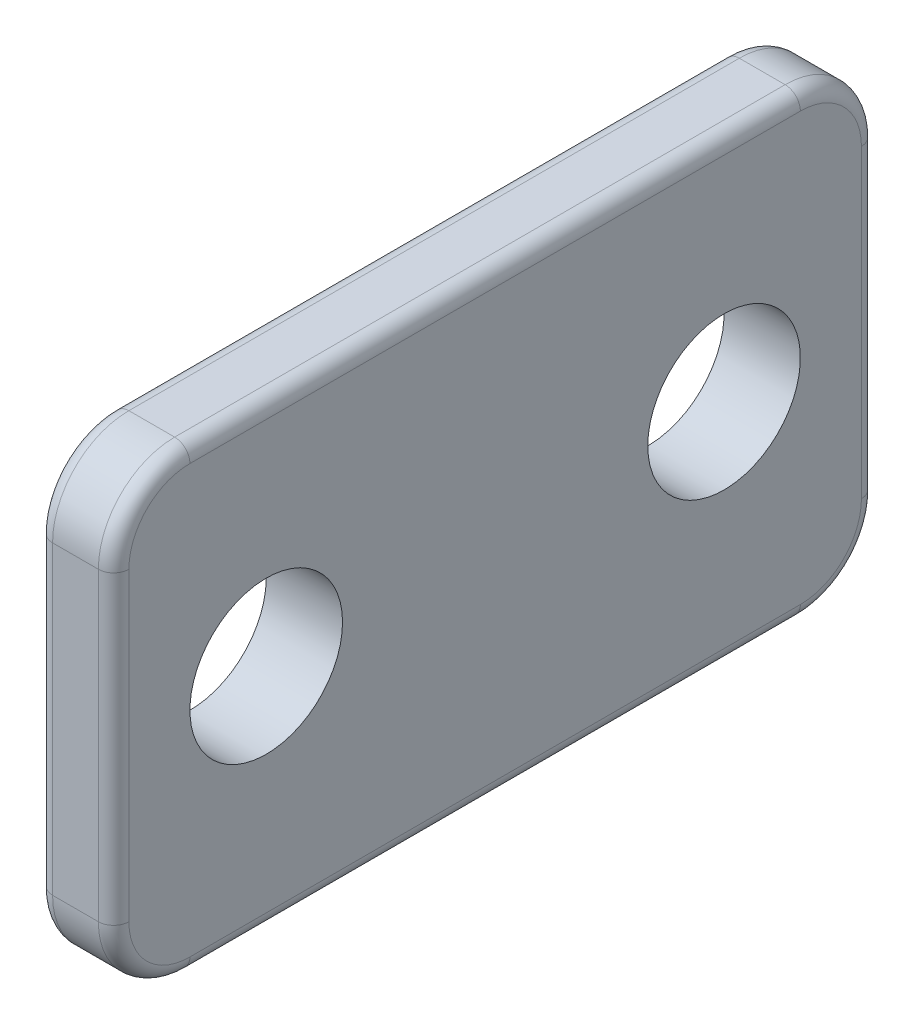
ISO-10303-21;
HEADER;
FILE_DESCRIPTION(('STEP AP214'),'2;1');
FILE_NAME('part.step','',(''),(''),'','','');
FILE_SCHEMA(('AUTOMOTIVE_DESIGN { 1 0 10303 214 1 1 1 1 }'));
ENDSEC;
DATA;
#1=APPLICATION_CONTEXT('core data for automotive mechanical design processes');
#2=APPLICATION_PROTOCOL_DEFINITION('international standard','automotive_design',2000,#1);
#3=PRODUCT_CONTEXT('',#1,'mechanical');
#4=PRODUCT('Part','Part','',(#3));
#5=PRODUCT_RELATED_PRODUCT_CATEGORY('part','',(#4));
#6=PRODUCT_DEFINITION_FORMATION('','',#4);
#7=PRODUCT_DEFINITION_CONTEXT('part definition',#1,'design');
#8=PRODUCT_DEFINITION('design','',#6,#7);
#9=PRODUCT_DEFINITION_SHAPE('','',#8);
#10=(LENGTH_UNIT() NAMED_UNIT(*) SI_UNIT(.MILLI.,.METRE.));
#11=(NAMED_UNIT(*) PLANE_ANGLE_UNIT() SI_UNIT($,.RADIAN.));
#12=(NAMED_UNIT(*) SI_UNIT($,.STERADIAN.) SOLID_ANGLE_UNIT());
#13=UNCERTAINTY_MEASURE_WITH_UNIT(LENGTH_MEASURE(1.E-05),#10,'distance_accuracy_value','');
#14=(GEOMETRIC_REPRESENTATION_CONTEXT(3) GLOBAL_UNCERTAINTY_ASSIGNED_CONTEXT((#13)) GLOBAL_UNIT_ASSIGNED_CONTEXT((#10,
#11,#12)) REPRESENTATION_CONTEXT('',''));
#15=CARTESIAN_POINT('',(0.,0.,0.));
#16=DIRECTION('',(0.,0.,1.));
#17=DIRECTION('',(1.,0.,0.));
#18=AXIS2_PLACEMENT_3D('',#15,#16,#17);
#19=CARTESIAN_POINT('',(2.5,10.,20.));
#20=DIRECTION('',(-1.,0.,0.));
#21=DIRECTION('',(0.,0.,-1.));
#22=AXIS2_PLACEMENT_3D('',#19,#20,#21);
#23=PLANE('',#22);
#24=DIRECTION('',(0.,1.,0.));
#25=VECTOR('',#24,1.);
#26=CARTESIAN_POINT('',(2.5,10.,24.));
#27=LINE('',#26,#25);
#28=CARTESIAN_POINT('',(2.5,-10.,24.));
#29=VERTEX_POINT('',#28);
#30=CARTESIAN_POINT('',(2.5,9.99999999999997,24.));
#31=VERTEX_POINT('',#30);
#32=EDGE_CURVE('E261',#29,#31,#27,.T.);
#33=ORIENTED_EDGE('',*,*,#32,.F.);
#34=CARTESIAN_POINT('',(2.5,-10.,20.));
#35=DIRECTION('',(1.,0.,0.));
#36=DIRECTION('',(0.,0.,-1.));
#37=AXIS2_PLACEMENT_3D('',#34,#35,#36);
#38=CIRCLE('',#37,4.);
#39=CARTESIAN_POINT('',(2.5,-14.,20.));
#40=VERTEX_POINT('',#39);
#41=EDGE_CURVE('E259',#40,#29,#38,.F.);
#42=ORIENTED_EDGE('',*,*,#41,.F.);
#43=DIRECTION('',(0.,0.,1.));
#44=VECTOR('',#43,1.);
#45=CARTESIAN_POINT('',(2.5,-14.,20.));
#46=LINE('',#45,#44);
#47=CARTESIAN_POINT('',(2.5,-14.,-20.));
#48=VERTEX_POINT('',#47);
#49=EDGE_CURVE('E256',#48,#40,#46,.T.);
#50=ORIENTED_EDGE('',*,*,#49,.F.);
#51=CARTESIAN_POINT('',(2.5,-10.,-20.));
#52=DIRECTION('',(1.,0.,0.));
#53=DIRECTION('',(0.,0.,-1.));
#54=AXIS2_PLACEMENT_3D('',#51,#52,#53);
#55=CIRCLE('',#54,4.);
#56=CARTESIAN_POINT('',(2.5,-9.99999999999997,-24.));
#57=VERTEX_POINT('',#56);
#58=EDGE_CURVE('E253',#57,#48,#55,.F.);
#59=ORIENTED_EDGE('',*,*,#58,.F.);
#60=DIRECTION('',(0.,-1.,0.));
#61=VECTOR('',#60,1.);
#62=CARTESIAN_POINT('',(2.5,10.,-24.));
#63=LINE('',#62,#61);
#64=CARTESIAN_POINT('',(2.5,9.99999999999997,-24.));
#65=VERTEX_POINT('',#64);
#66=EDGE_CURVE('E250',#65,#57,#63,.T.);
#67=ORIENTED_EDGE('',*,*,#66,.F.);
#68=CARTESIAN_POINT('',(2.5,10.,-20.));
#69=DIRECTION('',(1.,0.,0.));
#70=DIRECTION('',(0.,0.,-1.));
#71=AXIS2_PLACEMENT_3D('',#68,#69,#70);
#72=CIRCLE('',#71,4.);
#73=CARTESIAN_POINT('',(2.5,14.,-20.));
#74=VERTEX_POINT('',#73);
#75=EDGE_CURVE('E247',#74,#65,#72,.F.);
#76=ORIENTED_EDGE('',*,*,#75,.F.);
#77=DIRECTION('',(0.,0.,-1.));
#78=VECTOR('',#77,1.);
#79=CARTESIAN_POINT('',(2.5,14.,20.));
#80=LINE('',#79,#78);
#81=CARTESIAN_POINT('',(2.5,14.,20.));
#82=VERTEX_POINT('',#81);
#83=EDGE_CURVE('E245',#82,#74,#80,.T.);
#84=ORIENTED_EDGE('',*,*,#83,.F.);
#85=CARTESIAN_POINT('',(2.5,10.,20.));
#86=DIRECTION('',(1.,0.,0.));
#87=DIRECTION('',(0.,0.,-1.));
#88=AXIS2_PLACEMENT_3D('',#85,#86,#87);
#89=CIRCLE('',#88,4.);
#90=EDGE_CURVE('E157',#31,#82,#89,.F.);
#91=ORIENTED_EDGE('',*,*,#90,.F.);
#92=EDGE_LOOP('',(#33,#42,#50,#59,#67,#76,#84,#91));
#93=FACE_BOUND('',#92,.T.);
#94=CARTESIAN_POINT('',(2.5,0.,-15.));
#95=DIRECTION('',(-1.,0.,0.));
#96=DIRECTION('',(0.,0.,1.));
#97=AXIS2_PLACEMENT_3D('',#94,#95,#96);
#98=CIRCLE('',#97,5.);
#99=CARTESIAN_POINT('',(2.5,0.,-10.));
#100=VERTEX_POINT('',#99);
#101=EDGE_CURVE('E365',#100,#100,#98,.T.);
#102=ORIENTED_EDGE('',*,*,#101,.T.);
#103=EDGE_LOOP('',(#102));
#104=FACE_BOUND('',#103,.T.);
#105=CARTESIAN_POINT('',(2.5,0.,15.));
#106=DIRECTION('',(-1.,0.,0.));
#107=DIRECTION('',(0.,0.,-1.));
#108=AXIS2_PLACEMENT_3D('',#105,#106,#107);
#109=CIRCLE('',#108,5.);
#110=CARTESIAN_POINT('',(2.5,0.,10.));
#111=VERTEX_POINT('',#110);
#112=EDGE_CURVE('E371',#111,#111,#109,.T.);
#113=ORIENTED_EDGE('',*,*,#112,.T.);
#114=EDGE_LOOP('',(#113));
#115=FACE_BOUND('',#114,.T.);
#116=ADVANCED_FACE('F37',(#93,#104,#115),#23,.F.);
#117=CARTESIAN_POINT('',(-2.5,10.,20.));
#118=DIRECTION('',(-1.,0.,0.));
#119=DIRECTION('',(0.,0.,-1.));
#120=AXIS2_PLACEMENT_3D('',#117,#118,#119);
#121=PLANE('',#120);
#122=DIRECTION('',(0.,0.,-1.));
#123=VECTOR('',#122,1.);
#124=CARTESIAN_POINT('',(-2.5,14.,20.));
#125=LINE('',#124,#123);
#126=CARTESIAN_POINT('',(-2.5,14.,-20.));
#127=VERTEX_POINT('',#126);
#128=CARTESIAN_POINT('',(-2.5,14.,20.));
#129=VERTEX_POINT('',#128);
#130=EDGE_CURVE('E184',#127,#129,#125,.F.);
#131=ORIENTED_EDGE('',*,*,#130,.F.);
#132=CARTESIAN_POINT('',(-2.5,10.,-20.));
#133=DIRECTION('',(1.,0.,0.));
#134=DIRECTION('',(0.,0.,-1.));
#135=AXIS2_PLACEMENT_3D('',#132,#133,#134);
#136=CIRCLE('',#135,4.);
#137=CARTESIAN_POINT('',(-2.5,9.99999999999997,-24.));
#138=VERTEX_POINT('',#137);
#139=EDGE_CURVE('E190',#138,#127,#136,.T.);
#140=ORIENTED_EDGE('',*,*,#139,.F.);
#141=DIRECTION('',(0.,-1.,0.));
#142=VECTOR('',#141,1.);
#143=CARTESIAN_POINT('',(-2.5,9.99999999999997,-24.));
#144=LINE('',#143,#142);
#145=CARTESIAN_POINT('',(-2.5,-9.99999999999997,-24.));
#146=VERTEX_POINT('',#145);
#147=EDGE_CURVE('E193',#146,#138,#144,.F.);
#148=ORIENTED_EDGE('',*,*,#147,.F.);
#149=CARTESIAN_POINT('',(-2.5,-10.,-20.));
#150=DIRECTION('',(1.,0.,0.));
#151=DIRECTION('',(0.,0.,-1.));
#152=AXIS2_PLACEMENT_3D('',#149,#150,#151);
#153=CIRCLE('',#152,4.);
#154=CARTESIAN_POINT('',(-2.5,-14.,-20.));
#155=VERTEX_POINT('',#154);
#156=EDGE_CURVE('E196',#155,#146,#153,.T.);
#157=ORIENTED_EDGE('',*,*,#156,.F.);
#158=DIRECTION('',(0.,0.,1.));
#159=VECTOR('',#158,1.);
#160=CARTESIAN_POINT('',(-2.5,-14.,-20.));
#161=LINE('',#160,#159);
#162=CARTESIAN_POINT('',(-2.5,-14.,20.));
#163=VERTEX_POINT('',#162);
#164=EDGE_CURVE('E199',#163,#155,#161,.F.);
#165=ORIENTED_EDGE('',*,*,#164,.F.);
#166=CARTESIAN_POINT('',(-2.5,-10.,20.));
#167=DIRECTION('',(1.,0.,0.));
#168=DIRECTION('',(0.,0.,-1.));
#169=AXIS2_PLACEMENT_3D('',#166,#167,#168);
#170=CIRCLE('',#169,4.);
#171=CARTESIAN_POINT('',(-2.5,-10.,24.));
#172=VERTEX_POINT('',#171);
#173=EDGE_CURVE('E202',#172,#163,#170,.T.);
#174=ORIENTED_EDGE('',*,*,#173,.F.);
#175=DIRECTION('',(0.,1.,0.));
#176=VECTOR('',#175,1.);
#177=CARTESIAN_POINT('',(-2.5,-10.,24.));
#178=LINE('',#177,#176);
#179=CARTESIAN_POINT('',(-2.5,9.99999999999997,24.));
#180=VERTEX_POINT('',#179);
#181=EDGE_CURVE('E205',#180,#172,#178,.F.);
#182=ORIENTED_EDGE('',*,*,#181,.F.);
#183=CARTESIAN_POINT('',(-2.5,10.,20.));
#184=DIRECTION('',(1.,0.,0.));
#185=DIRECTION('',(0.,0.,-1.));
#186=AXIS2_PLACEMENT_3D('',#183,#184,#185);
#187=CIRCLE('',#186,4.);
#188=EDGE_CURVE('E208',#129,#180,#187,.T.);
#189=ORIENTED_EDGE('',*,*,#188,.F.);
#190=EDGE_LOOP('',(#131,#140,#148,#157,#165,#174,#182,#189));
#191=FACE_BOUND('',#190,.T.);
#192=CARTESIAN_POINT('',(-2.5,0.,-15.));
#193=DIRECTION('',(-1.,0.,0.));
#194=DIRECTION('',(0.,0.,1.));
#195=AXIS2_PLACEMENT_3D('',#192,#193,#194);
#196=CIRCLE('',#195,5.);
#197=CARTESIAN_POINT('',(-2.5,0.,-10.));
#198=VERTEX_POINT('',#197);
#199=EDGE_CURVE('E367',#198,#198,#196,.T.);
#200=ORIENTED_EDGE('',*,*,#199,.F.);
#201=EDGE_LOOP('',(#200));
#202=FACE_BOUND('',#201,.T.);
#203=CARTESIAN_POINT('',(-2.5,0.,15.));
#204=DIRECTION('',(-1.,0.,0.));
#205=DIRECTION('',(0.,0.,-1.));
#206=AXIS2_PLACEMENT_3D('',#203,#204,#205);
#207=CIRCLE('',#206,5.);
#208=CARTESIAN_POINT('',(-2.5,0.,10.));
#209=VERTEX_POINT('',#208);
#210=EDGE_CURVE('E279',#209,#209,#207,.T.);
#211=ORIENTED_EDGE('',*,*,#210,.F.);
#212=EDGE_LOOP('',(#211));
#213=FACE_BOUND('',#212,.T.);
#214=ADVANCED_FACE('F353',(#191,#202,#213),#121,.T.);
#215=CARTESIAN_POINT('',(2.5,10.,20.));
#216=DIRECTION('',(-1.,0.,0.));
#217=DIRECTION('',(0.,0.,-1.));
#218=AXIS2_PLACEMENT_3D('',#215,#216,#217);
#219=CYLINDRICAL_SURFACE('',#218,5.);
#220=DIRECTION('',(-1.,0.,0.));
#221=VECTOR('',#220,1.);
#222=CARTESIAN_POINT('',(2.5,9.99999999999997,25.));
#223=LINE('',#222,#221);
#224=CARTESIAN_POINT('',(1.5,9.99999999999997,25.));
#225=VERTEX_POINT('',#224);
#226=CARTESIAN_POINT('',(-1.5,9.99999999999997,25.));
#227=VERTEX_POINT('',#226);
#228=EDGE_CURVE('E181',#225,#227,#223,.T.);
#229=ORIENTED_EDGE('',*,*,#228,.F.);
#230=CARTESIAN_POINT('',(1.5,10.,20.));
#231=DIRECTION('',(1.,0.,0.));
#232=DIRECTION('',(0.,0.,-1.));
#233=AXIS2_PLACEMENT_3D('',#230,#231,#232);
#234=CIRCLE('',#233,5.);
#235=CARTESIAN_POINT('',(1.5,15.,20.));
#236=VERTEX_POINT('',#235);
#237=EDGE_CURVE('E155',#236,#225,#234,.T.);
#238=ORIENTED_EDGE('',*,*,#237,.F.);
#239=DIRECTION('',(-1.,0.,0.));
#240=VECTOR('',#239,1.);
#241=CARTESIAN_POINT('',(2.5,15.,20.));
#242=LINE('',#241,#240);
#243=CARTESIAN_POINT('',(-1.5,15.,20.));
#244=VERTEX_POINT('',#243);
#245=EDGE_CURVE('E172',#236,#244,#242,.T.);
#246=ORIENTED_EDGE('',*,*,#245,.T.);
#247=CARTESIAN_POINT('',(-1.5,10.,20.));
#248=DIRECTION('',(1.,0.,0.));
#249=DIRECTION('',(0.,0.,-1.));
#250=AXIS2_PLACEMENT_3D('',#247,#248,#249);
#251=CIRCLE('',#250,5.);
#252=EDGE_CURVE('E182',#227,#244,#251,.F.);
#253=ORIENTED_EDGE('',*,*,#252,.F.);
#254=EDGE_LOOP('',(#229,#238,#246,#253));
#255=FACE_BOUND('',#254,.T.);
#256=ADVANCED_FACE('F179',(#255),#219,.T.);
#257=CARTESIAN_POINT('',(2.5,15.,-20.));
#258=DIRECTION('',(0.,-1.,0.));
#259=DIRECTION('',(0.,0.,1.));
#260=AXIS2_PLACEMENT_3D('',#257,#258,#259);
#261=PLANE('',#260);
#262=ORIENTED_EDGE('',*,*,#245,.F.);
#263=DIRECTION('',(0.,0.,-1.));
#264=VECTOR('',#263,1.);
#265=CARTESIAN_POINT('',(1.5,15.,-20.));
#266=LINE('',#265,#264);
#267=CARTESIAN_POINT('',(1.5,15.,-20.));
#268=VERTEX_POINT('',#267);
#269=EDGE_CURVE('E46',#268,#236,#266,.F.);
#270=ORIENTED_EDGE('',*,*,#269,.F.);
#271=DIRECTION('',(-1.,0.,0.));
#272=VECTOR('',#271,1.);
#273=CARTESIAN_POINT('',(2.5,15.,-20.));
#274=LINE('',#273,#272);
#275=CARTESIAN_POINT('',(-1.5,15.,-20.));
#276=VERTEX_POINT('',#275);
#277=EDGE_CURVE('E177',#268,#276,#274,.T.);
#278=ORIENTED_EDGE('',*,*,#277,.T.);
#279=DIRECTION('',(0.,0.,-1.));
#280=VECTOR('',#279,1.);
#281=CARTESIAN_POINT('',(-1.5,15.,-20.));
#282=LINE('',#281,#280);
#283=EDGE_CURVE('E11',#244,#276,#282,.T.);
#284=ORIENTED_EDGE('',*,*,#283,.F.);
#285=EDGE_LOOP('',(#262,#270,#278,#284));
#286=FACE_BOUND('',#285,.T.);
#287=ADVANCED_FACE('F173',(#286),#261,.F.);
#288=CARTESIAN_POINT('',(2.5,10.,-20.));
#289=DIRECTION('',(-1.,0.,0.));
#290=DIRECTION('',(0.,0.,-1.));
#291=AXIS2_PLACEMENT_3D('',#288,#289,#290);
#292=CYLINDRICAL_SURFACE('',#291,5.);
#293=ORIENTED_EDGE('',*,*,#277,.F.);
#294=CARTESIAN_POINT('',(1.5,10.,-20.));
#295=DIRECTION('',(1.,0.,0.));
#296=DIRECTION('',(0.,0.,-1.));
#297=AXIS2_PLACEMENT_3D('',#294,#295,#296);
#298=CIRCLE('',#297,5.);
#299=CARTESIAN_POINT('',(1.5,9.99999999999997,-25.));
#300=VERTEX_POINT('',#299);
#301=EDGE_CURVE('E240',#300,#268,#298,.T.);
#302=ORIENTED_EDGE('',*,*,#301,.F.);
#303=DIRECTION('',(-1.,0.,0.));
#304=VECTOR('',#303,1.);
#305=CARTESIAN_POINT('',(2.5,9.99999999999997,-25.));
#306=LINE('',#305,#304);
#307=CARTESIAN_POINT('',(-1.5,9.99999999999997,-25.));
#308=VERTEX_POINT('',#307);
#309=EDGE_CURVE('E313',#300,#308,#306,.T.);
#310=ORIENTED_EDGE('',*,*,#309,.T.);
#311=CARTESIAN_POINT('',(-1.5,10.,-20.));
#312=DIRECTION('',(1.,0.,0.));
#313=DIRECTION('',(0.,0.,-1.));
#314=AXIS2_PLACEMENT_3D('',#311,#312,#313);
#315=CIRCLE('',#314,5.);
#316=EDGE_CURVE('E242',#276,#308,#315,.F.);
#317=ORIENTED_EDGE('',*,*,#316,.F.);
#318=EDGE_LOOP('',(#293,#302,#310,#317));
#319=FACE_BOUND('',#318,.T.);
#320=ADVANCED_FACE('F343',(#319),#292,.T.);
#321=CARTESIAN_POINT('',(2.5,9.99999999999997,-25.));
#322=DIRECTION('',(0.,0.,1.));
#323=DIRECTION('',(-1.,0.,0.));
#324=AXIS2_PLACEMENT_3D('',#321,#322,#323);
#325=PLANE('',#324);
#326=ORIENTED_EDGE('',*,*,#309,.F.);
#327=DIRECTION('',(0.,-1.,0.));
#328=VECTOR('',#327,1.);
#329=CARTESIAN_POINT('',(1.5,9.99999999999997,-25.));
#330=LINE('',#329,#328);
#331=CARTESIAN_POINT('',(1.5,-9.99999999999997,-25.));
#332=VERTEX_POINT('',#331);
#333=EDGE_CURVE('E234',#332,#300,#330,.F.);
#334=ORIENTED_EDGE('',*,*,#333,.F.);
#335=DIRECTION('',(-1.,0.,0.));
#336=VECTOR('',#335,1.);
#337=CARTESIAN_POINT('',(2.5,-9.99999999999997,-25.));
#338=LINE('',#337,#336);
#339=CARTESIAN_POINT('',(-1.5,-9.99999999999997,-25.));
#340=VERTEX_POINT('',#339);
#341=EDGE_CURVE('E305',#332,#340,#338,.T.);
#342=ORIENTED_EDGE('',*,*,#341,.T.);
#343=DIRECTION('',(0.,-1.,0.));
#344=VECTOR('',#343,1.);
#345=CARTESIAN_POINT('',(-1.5,-9.99999999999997,-25.));
#346=LINE('',#345,#344);
#347=EDGE_CURVE('E237',#308,#340,#346,.T.);
#348=ORIENTED_EDGE('',*,*,#347,.F.);
#349=EDGE_LOOP('',(#326,#334,#342,#348));
#350=FACE_BOUND('',#349,.T.);
#351=ADVANCED_FACE('F316',(#350),#325,.F.);
#352=CARTESIAN_POINT('',(2.5,-10.,-20.));
#353=DIRECTION('',(-1.,0.,0.));
#354=DIRECTION('',(0.,0.,-1.));
#355=AXIS2_PLACEMENT_3D('',#352,#353,#354);
#356=CYLINDRICAL_SURFACE('',#355,5.);
#357=ORIENTED_EDGE('',*,*,#341,.F.);
#358=CARTESIAN_POINT('',(1.5,-10.,-20.));
#359=DIRECTION('',(1.,0.,0.));
#360=DIRECTION('',(0.,0.,-1.));
#361=AXIS2_PLACEMENT_3D('',#358,#359,#360);
#362=CIRCLE('',#361,5.);
#363=CARTESIAN_POINT('',(1.5,-15.,-20.));
#364=VERTEX_POINT('',#363);
#365=EDGE_CURVE('E228',#364,#332,#362,.T.);
#366=ORIENTED_EDGE('',*,*,#365,.F.);
#367=DIRECTION('',(-1.,0.,0.));
#368=VECTOR('',#367,1.);
#369=CARTESIAN_POINT('',(2.5,-15.,-20.));
#370=LINE('',#369,#368);
#371=CARTESIAN_POINT('',(-1.5,-15.,-20.));
#372=VERTEX_POINT('',#371);
#373=EDGE_CURVE('E301',#364,#372,#370,.T.);
#374=ORIENTED_EDGE('',*,*,#373,.T.);
#375=CARTESIAN_POINT('',(-1.5,-10.,-20.));
#376=DIRECTION('',(1.,0.,0.));
#377=DIRECTION('',(0.,0.,-1.));
#378=AXIS2_PLACEMENT_3D('',#375,#376,#377);
#379=CIRCLE('',#378,5.);
#380=EDGE_CURVE('E231',#340,#372,#379,.F.);
#381=ORIENTED_EDGE('',*,*,#380,.F.);
#382=EDGE_LOOP('',(#357,#366,#374,#381));
#383=FACE_BOUND('',#382,.T.);
#384=ADVANCED_FACE('F308',(#383),#356,.T.);
#385=CARTESIAN_POINT('',(2.5,-15.,-20.));
#386=DIRECTION('',(0.,1.,0.));
#387=DIRECTION('',(0.,0.,-1.));
#388=AXIS2_PLACEMENT_3D('',#385,#386,#387);
#389=PLANE('',#388);
#390=ORIENTED_EDGE('',*,*,#373,.F.);
#391=DIRECTION('',(0.,0.,1.));
#392=VECTOR('',#391,1.);
#393=CARTESIAN_POINT('',(1.5,-15.,-20.));
#394=LINE('',#393,#392);
#395=CARTESIAN_POINT('',(1.5,-15.,20.));
#396=VERTEX_POINT('',#395);
#397=EDGE_CURVE('E222',#396,#364,#394,.F.);
#398=ORIENTED_EDGE('',*,*,#397,.F.);
#399=DIRECTION('',(-1.,0.,0.));
#400=VECTOR('',#399,1.);
#401=CARTESIAN_POINT('',(2.5,-15.,20.));
#402=LINE('',#401,#400);
#403=CARTESIAN_POINT('',(-1.5,-15.,20.));
#404=VERTEX_POINT('',#403);
#405=EDGE_CURVE('E306',#396,#404,#402,.T.);
#406=ORIENTED_EDGE('',*,*,#405,.T.);
#407=DIRECTION('',(0.,0.,1.));
#408=VECTOR('',#407,1.);
#409=CARTESIAN_POINT('',(-1.5,-15.,20.));
#410=LINE('',#409,#408);
#411=EDGE_CURVE('E225',#372,#404,#410,.T.);
#412=ORIENTED_EDGE('',*,*,#411,.F.);
#413=EDGE_LOOP('',(#390,#398,#406,#412));
#414=FACE_BOUND('',#413,.T.);
#415=ADVANCED_FACE('F302',(#414),#389,.F.);
#416=CARTESIAN_POINT('',(2.5,-10.,20.));
#417=DIRECTION('',(-1.,0.,0.));
#418=DIRECTION('',(0.,0.,-1.));
#419=AXIS2_PLACEMENT_3D('',#416,#417,#418);
#420=CYLINDRICAL_SURFACE('',#419,5.);
#421=ORIENTED_EDGE('',*,*,#405,.F.);
#422=CARTESIAN_POINT('',(1.5,-10.,20.));
#423=DIRECTION('',(1.,0.,0.));
#424=DIRECTION('',(0.,0.,-1.));
#425=AXIS2_PLACEMENT_3D('',#422,#423,#424);
#426=CIRCLE('',#425,5.);
#427=CARTESIAN_POINT('',(1.5,-10.,25.));
#428=VERTEX_POINT('',#427);
#429=EDGE_CURVE('E216',#428,#396,#426,.T.);
#430=ORIENTED_EDGE('',*,*,#429,.F.);
#431=DIRECTION('',(-1.,0.,0.));
#432=VECTOR('',#431,1.);
#433=CARTESIAN_POINT('',(2.5,-10.,25.));
#434=LINE('',#433,#432);
#435=CARTESIAN_POINT('',(-1.5,-10.,25.));
#436=VERTEX_POINT('',#435);
#437=EDGE_CURVE('E335',#428,#436,#434,.T.);
#438=ORIENTED_EDGE('',*,*,#437,.T.);
#439=CARTESIAN_POINT('',(-1.5,-10.,20.));
#440=DIRECTION('',(1.,0.,0.));
#441=DIRECTION('',(0.,0.,-1.));
#442=AXIS2_PLACEMENT_3D('',#439,#440,#441);
#443=CIRCLE('',#442,5.);
#444=EDGE_CURVE('E219',#404,#436,#443,.F.);
#445=ORIENTED_EDGE('',*,*,#444,.F.);
#446=EDGE_LOOP('',(#421,#430,#438,#445));
#447=FACE_BOUND('',#446,.T.);
#448=ADVANCED_FACE('F334',(#447),#420,.T.);
#449=CARTESIAN_POINT('',(2.5,9.99999999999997,25.));
#450=DIRECTION('',(0.,0.,-1.));
#451=DIRECTION('',(1.,0.,0.));
#452=AXIS2_PLACEMENT_3D('',#449,#450,#451);
#453=PLANE('',#452);
#454=ORIENTED_EDGE('',*,*,#437,.F.);
#455=DIRECTION('',(0.,1.,0.));
#456=VECTOR('',#455,1.);
#457=CARTESIAN_POINT('',(1.5,9.99999999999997,25.));
#458=LINE('',#457,#456);
#459=EDGE_CURVE('E211',#225,#428,#458,.F.);
#460=ORIENTED_EDGE('',*,*,#459,.F.);
#461=ORIENTED_EDGE('',*,*,#228,.T.);
#462=DIRECTION('',(0.,1.,0.));
#463=VECTOR('',#462,1.);
#464=CARTESIAN_POINT('',(-1.5,9.99999999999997,25.));
#465=LINE('',#464,#463);
#466=EDGE_CURVE('E213',#436,#227,#465,.T.);
#467=ORIENTED_EDGE('',*,*,#466,.F.);
#468=EDGE_LOOP('',(#454,#460,#461,#467));
#469=FACE_BOUND('',#468,.T.);
#470=ADVANCED_FACE('F364',(#469),#453,.F.);
#471=CARTESIAN_POINT('',(2.5,0.,-15.));
#472=DIRECTION('',(-1.,0.,0.));
#473=DIRECTION('',(0.,0.,-1.));
#474=AXIS2_PLACEMENT_3D('',#471,#472,#473);
#475=CYLINDRICAL_SURFACE('',#474,5.);
#476=ORIENTED_EDGE('',*,*,#101,.F.);
#477=EDGE_LOOP('',(#476));
#478=FACE_BOUND('',#477,.T.);
#479=ORIENTED_EDGE('',*,*,#199,.T.);
#480=EDGE_LOOP('',(#479));
#481=FACE_BOUND('',#480,.T.);
#482=ADVANCED_FACE('F383',(#478,#481),#475,.F.);
#483=CARTESIAN_POINT('',(2.5,0.,15.));
#484=DIRECTION('',(-1.,0.,0.));
#485=DIRECTION('',(0.,0.,-1.));
#486=AXIS2_PLACEMENT_3D('',#483,#484,#485);
#487=CYLINDRICAL_SURFACE('',#486,5.);
#488=ORIENTED_EDGE('',*,*,#112,.F.);
#489=EDGE_LOOP('',(#488));
#490=FACE_BOUND('',#489,.T.);
#491=ORIENTED_EDGE('',*,*,#210,.T.);
#492=EDGE_LOOP('',(#491));
#493=FACE_BOUND('',#492,.T.);
#494=ADVANCED_FACE('F379',(#490,#493),#487,.F.);
#495=CARTESIAN_POINT('',(-1.5,-10.,-20.));
#496=DIRECTION('',(-1.,0.,0.));
#497=DIRECTION('',(0.,0.,-1.));
#498=AXIS2_PLACEMENT_3D('',#495,#496,#497);
#499=TOROIDAL_SURFACE('',#498,4.,1.);
#500=CARTESIAN_POINT('',(-1.5,-9.99999999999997,-24.));
#501=DIRECTION('',(0.,-1.,0.));
#502=DIRECTION('',(0.,0.,-1.));
#503=AXIS2_PLACEMENT_3D('',#500,#501,#502);
#504=CIRCLE('',#503,1.);
#505=EDGE_CURVE('E276',#146,#340,#504,.T.);
#506=ORIENTED_EDGE('',*,*,#505,.T.);
#507=ORIENTED_EDGE('',*,*,#380,.T.);
#508=CARTESIAN_POINT('',(-1.5,-14.,-20.));
#509=DIRECTION('',(0.,0.,-1.));
#510=DIRECTION('',(0.,1.,0.));
#511=AXIS2_PLACEMENT_3D('',#508,#509,#510);
#512=CIRCLE('',#511,1.);
#513=EDGE_CURVE('E278',#372,#155,#512,.T.);
#514=ORIENTED_EDGE('',*,*,#513,.T.);
#515=ORIENTED_EDGE('',*,*,#156,.T.);
#516=EDGE_LOOP('',(#506,#507,#514,#515));
#517=FACE_BOUND('',#516,.T.);
#518=ADVANCED_FACE('F382',(#517),#499,.T.);
#519=CARTESIAN_POINT('',(-1.5,-14.,-20.));
#520=DIRECTION('',(0.,0.,-1.));
#521=DIRECTION('',(1.,0.,0.));
#522=AXIS2_PLACEMENT_3D('',#519,#520,#521);
#523=CYLINDRICAL_SURFACE('',#522,1.);
#524=ORIENTED_EDGE('',*,*,#513,.F.);
#525=ORIENTED_EDGE('',*,*,#411,.T.);
#526=CARTESIAN_POINT('',(-1.5,-14.,20.));
#527=DIRECTION('',(0.,0.,-1.));
#528=DIRECTION('',(-1.,0.,0.));
#529=AXIS2_PLACEMENT_3D('',#526,#527,#528);
#530=CIRCLE('',#529,1.);
#531=EDGE_CURVE('E274',#404,#163,#530,.T.);
#532=ORIENTED_EDGE('',*,*,#531,.T.);
#533=ORIENTED_EDGE('',*,*,#164,.T.);
#534=EDGE_LOOP('',(#524,#525,#532,#533));
#535=FACE_BOUND('',#534,.T.);
#536=ADVANCED_FACE('F427',(#535),#523,.T.);
#537=CARTESIAN_POINT('',(-1.5,9.99999999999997,-24.));
#538=DIRECTION('',(0.,1.,0.));
#539=DIRECTION('',(0.,0.,-1.));
#540=AXIS2_PLACEMENT_3D('',#537,#538,#539);
#541=CYLINDRICAL_SURFACE('',#540,1.);
#542=ORIENTED_EDGE('',*,*,#505,.F.);
#543=ORIENTED_EDGE('',*,*,#147,.T.);
#544=CARTESIAN_POINT('',(-1.5,9.99999999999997,-24.));
#545=DIRECTION('',(0.,-1.,0.));
#546=DIRECTION('',(0.,0.,-1.));
#547=AXIS2_PLACEMENT_3D('',#544,#545,#546);
#548=CIRCLE('',#547,1.);
#549=EDGE_CURVE('E272',#138,#308,#548,.T.);
#550=ORIENTED_EDGE('',*,*,#549,.T.);
#551=ORIENTED_EDGE('',*,*,#347,.T.);
#552=EDGE_LOOP('',(#542,#543,#550,#551));
#553=FACE_BOUND('',#552,.T.);
#554=ADVANCED_FACE('F423',(#553),#541,.T.);
#555=CARTESIAN_POINT('',(-1.5,-10.,20.));
#556=DIRECTION('',(-1.,0.,0.));
#557=DIRECTION('',(0.,0.,-1.));
#558=AXIS2_PLACEMENT_3D('',#555,#556,#557);
#559=TOROIDAL_SURFACE('',#558,4.,1.);
#560=ORIENTED_EDGE('',*,*,#531,.F.);
#561=ORIENTED_EDGE('',*,*,#444,.T.);
#562=CARTESIAN_POINT('',(-1.5,-10.,24.));
#563=DIRECTION('',(0.,-1.,0.));
#564=DIRECTION('',(0.,0.,-1.));
#565=AXIS2_PLACEMENT_3D('',#562,#563,#564);
#566=CIRCLE('',#565,1.);
#567=EDGE_CURVE('E270',#436,#172,#566,.T.);
#568=ORIENTED_EDGE('',*,*,#567,.T.);
#569=ORIENTED_EDGE('',*,*,#173,.T.);
#570=EDGE_LOOP('',(#560,#561,#568,#569));
#571=FACE_BOUND('',#570,.T.);
#572=ADVANCED_FACE('F420',(#571),#559,.T.);
#573=CARTESIAN_POINT('',(-1.5,10.,-20.));
#574=DIRECTION('',(-1.,0.,0.));
#575=DIRECTION('',(0.,0.,-1.));
#576=AXIS2_PLACEMENT_3D('',#573,#574,#575);
#577=TOROIDAL_SURFACE('',#576,4.,1.);
#578=ORIENTED_EDGE('',*,*,#549,.F.);
#579=ORIENTED_EDGE('',*,*,#139,.T.);
#580=CARTESIAN_POINT('',(-1.5,14.,-20.));
#581=DIRECTION('',(0.,0.,-1.));
#582=DIRECTION('',(0.,1.,0.));
#583=AXIS2_PLACEMENT_3D('',#580,#581,#582);
#584=CIRCLE('',#583,1.);
#585=EDGE_CURVE('E268',#127,#276,#584,.T.);
#586=ORIENTED_EDGE('',*,*,#585,.T.);
#587=ORIENTED_EDGE('',*,*,#316,.T.);
#588=EDGE_LOOP('',(#578,#579,#586,#587));
#589=FACE_BOUND('',#588,.T.);
#590=ADVANCED_FACE('F417',(#589),#577,.T.);
#591=CARTESIAN_POINT('',(-1.5,9.99999999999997,24.));
#592=DIRECTION('',(0.,-1.,0.));
#593=DIRECTION('',(0.,0.,1.));
#594=AXIS2_PLACEMENT_3D('',#591,#592,#593);
#595=CYLINDRICAL_SURFACE('',#594,1.);
#596=ORIENTED_EDGE('',*,*,#567,.F.);
#597=ORIENTED_EDGE('',*,*,#466,.T.);
#598=CARTESIAN_POINT('',(-1.5,9.99999999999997,24.));
#599=DIRECTION('',(0.,-1.,0.));
#600=DIRECTION('',(-1.,0.,0.));
#601=AXIS2_PLACEMENT_3D('',#598,#599,#600);
#602=CIRCLE('',#601,1.);
#603=EDGE_CURVE('E266',#227,#180,#602,.T.);
#604=ORIENTED_EDGE('',*,*,#603,.T.);
#605=ORIENTED_EDGE('',*,*,#181,.T.);
#606=EDGE_LOOP('',(#596,#597,#604,#605));
#607=FACE_BOUND('',#606,.T.);
#608=ADVANCED_FACE('F359',(#607),#595,.T.);
#609=CARTESIAN_POINT('',(-1.5,14.,-20.));
#610=DIRECTION('',(0.,0.,1.));
#611=DIRECTION('',(-1.,0.,0.));
#612=AXIS2_PLACEMENT_3D('',#609,#610,#611);
#613=CYLINDRICAL_SURFACE('',#612,1.);
#614=ORIENTED_EDGE('',*,*,#585,.F.);
#615=ORIENTED_EDGE('',*,*,#130,.T.);
#616=CARTESIAN_POINT('',(-1.5,14.,20.));
#617=DIRECTION('',(0.,0.,-1.));
#618=DIRECTION('',(0.,1.,0.));
#619=AXIS2_PLACEMENT_3D('',#616,#617,#618);
#620=CIRCLE('',#619,1.);
#621=EDGE_CURVE('E264',#129,#244,#620,.T.);
#622=ORIENTED_EDGE('',*,*,#621,.T.);
#623=ORIENTED_EDGE('',*,*,#283,.T.);
#624=EDGE_LOOP('',(#614,#615,#622,#623));
#625=FACE_BOUND('',#624,.T.);
#626=ADVANCED_FACE('F346',(#625),#613,.T.);
#627=CARTESIAN_POINT('',(-1.5,10.,20.));
#628=DIRECTION('',(-1.,0.,0.));
#629=DIRECTION('',(0.,0.,-1.));
#630=AXIS2_PLACEMENT_3D('',#627,#628,#629);
#631=TOROIDAL_SURFACE('',#630,4.,1.);
#632=ORIENTED_EDGE('',*,*,#603,.F.);
#633=ORIENTED_EDGE('',*,*,#252,.T.);
#634=ORIENTED_EDGE('',*,*,#621,.F.);
#635=ORIENTED_EDGE('',*,*,#188,.T.);
#636=EDGE_LOOP('',(#632,#633,#634,#635));
#637=FACE_BOUND('',#636,.T.);
#638=ADVANCED_FACE('F350',(#637),#631,.T.);
#639=CARTESIAN_POINT('',(1.5,-10.,-20.));
#640=DIRECTION('',(-1.,0.,0.));
#641=DIRECTION('',(0.,0.,-1.));
#642=AXIS2_PLACEMENT_3D('',#639,#640,#641);
#643=TOROIDAL_SURFACE('',#642,4.,1.);
#644=CARTESIAN_POINT('',(1.5,-9.99999999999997,-24.));
#645=DIRECTION('',(0.,-1.,0.));
#646=DIRECTION('',(0.,0.,-1.));
#647=AXIS2_PLACEMENT_3D('',#644,#645,#646);
#648=CIRCLE('',#647,1.);
#649=EDGE_CURVE('E287',#332,#57,#648,.T.);
#650=ORIENTED_EDGE('',*,*,#649,.T.);
#651=ORIENTED_EDGE('',*,*,#58,.T.);
#652=CARTESIAN_POINT('',(1.5,-14.,-20.));
#653=DIRECTION('',(0.,0.,-1.));
#654=DIRECTION('',(-1.,0.,0.));
#655=AXIS2_PLACEMENT_3D('',#652,#653,#654);
#656=CIRCLE('',#655,1.);
#657=EDGE_CURVE('E41',#48,#364,#656,.T.);
#658=ORIENTED_EDGE('',*,*,#657,.T.);
#659=ORIENTED_EDGE('',*,*,#365,.T.);
#660=EDGE_LOOP('',(#650,#651,#658,#659));
#661=FACE_BOUND('',#660,.T.);
#662=ADVANCED_FACE('F39',(#661),#643,.T.);
#663=CARTESIAN_POINT('',(1.5,-14.,20.));
#664=DIRECTION('',(0.,0.,1.));
#665=DIRECTION('',(-1.,0.,0.));
#666=AXIS2_PLACEMENT_3D('',#663,#664,#665);
#667=CYLINDRICAL_SURFACE('',#666,1.);
#668=ORIENTED_EDGE('',*,*,#657,.F.);
#669=ORIENTED_EDGE('',*,*,#49,.T.);
#670=CARTESIAN_POINT('',(1.5,-14.,20.));
#671=DIRECTION('',(0.,0.,-1.));
#672=DIRECTION('',(0.,1.,0.));
#673=AXIS2_PLACEMENT_3D('',#670,#671,#672);
#674=CIRCLE('',#673,1.);
#675=EDGE_CURVE('E286',#40,#396,#674,.T.);
#676=ORIENTED_EDGE('',*,*,#675,.T.);
#677=ORIENTED_EDGE('',*,*,#397,.T.);
#678=EDGE_LOOP('',(#668,#669,#676,#677));
#679=FACE_BOUND('',#678,.T.);
#680=ADVANCED_FACE('F296',(#679),#667,.T.);
#681=CARTESIAN_POINT('',(1.5,10.,-24.));
#682=DIRECTION('',(0.,-1.,0.));
#683=DIRECTION('',(0.,0.,1.));
#684=AXIS2_PLACEMENT_3D('',#681,#682,#683);
#685=CYLINDRICAL_SURFACE('',#684,1.);
#686=ORIENTED_EDGE('',*,*,#649,.F.);
#687=ORIENTED_EDGE('',*,*,#333,.T.);
#688=CARTESIAN_POINT('',(1.5,9.99999999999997,-24.));
#689=DIRECTION('',(0.,-1.,0.));
#690=DIRECTION('',(0.,0.,-1.));
#691=AXIS2_PLACEMENT_3D('',#688,#689,#690);
#692=CIRCLE('',#691,1.);
#693=EDGE_CURVE('E284',#300,#65,#692,.T.);
#694=ORIENTED_EDGE('',*,*,#693,.T.);
#695=ORIENTED_EDGE('',*,*,#66,.T.);
#696=EDGE_LOOP('',(#686,#687,#694,#695));
#697=FACE_BOUND('',#696,.T.);
#698=ADVANCED_FACE('F320',(#697),#685,.T.);
#699=CARTESIAN_POINT('',(1.5,-10.,20.));
#700=DIRECTION('',(-1.,0.,0.));
#701=DIRECTION('',(0.,0.,-1.));
#702=AXIS2_PLACEMENT_3D('',#699,#700,#701);
#703=TOROIDAL_SURFACE('',#702,4.,1.);
#704=ORIENTED_EDGE('',*,*,#675,.F.);
#705=ORIENTED_EDGE('',*,*,#41,.T.);
#706=CARTESIAN_POINT('',(1.5,-10.,24.));
#707=DIRECTION('',(0.,-1.,0.));
#708=DIRECTION('',(0.,0.,-1.));
#709=AXIS2_PLACEMENT_3D('',#706,#707,#708);
#710=CIRCLE('',#709,1.);
#711=EDGE_CURVE('E62',#29,#428,#710,.T.);
#712=ORIENTED_EDGE('',*,*,#711,.T.);
#713=ORIENTED_EDGE('',*,*,#429,.T.);
#714=EDGE_LOOP('',(#704,#705,#712,#713));
#715=FACE_BOUND('',#714,.T.);
#716=ADVANCED_FACE('F328',(#715),#703,.T.);
#717=CARTESIAN_POINT('',(1.5,10.,-20.));
#718=DIRECTION('',(-1.,0.,0.));
#719=DIRECTION('',(0.,0.,-1.));
#720=AXIS2_PLACEMENT_3D('',#717,#718,#719);
#721=TOROIDAL_SURFACE('',#720,4.,1.);
#722=ORIENTED_EDGE('',*,*,#693,.F.);
#723=ORIENTED_EDGE('',*,*,#301,.T.);
#724=CARTESIAN_POINT('',(1.5,14.,-20.));
#725=DIRECTION('',(0.,0.,-1.));
#726=DIRECTION('',(0.,1.,0.));
#727=AXIS2_PLACEMENT_3D('',#724,#725,#726);
#728=CIRCLE('',#727,1.);
#729=EDGE_CURVE('E165',#268,#74,#728,.T.);
#730=ORIENTED_EDGE('',*,*,#729,.T.);
#731=ORIENTED_EDGE('',*,*,#75,.T.);
#732=EDGE_LOOP('',(#722,#723,#730,#731));
#733=FACE_BOUND('',#732,.T.);
#734=ADVANCED_FACE('F442',(#733),#721,.T.);
#735=CARTESIAN_POINT('',(1.5,10.,24.));
#736=DIRECTION('',(0.,1.,0.));
#737=DIRECTION('',(0.,0.,-1.));
#738=AXIS2_PLACEMENT_3D('',#735,#736,#737);
#739=CYLINDRICAL_SURFACE('',#738,1.);
#740=ORIENTED_EDGE('',*,*,#711,.F.);
#741=ORIENTED_EDGE('',*,*,#32,.T.);
#742=CARTESIAN_POINT('',(1.5,9.99999999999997,24.));
#743=DIRECTION('',(0.,-1.,0.));
#744=DIRECTION('',(0.,0.,-1.));
#745=AXIS2_PLACEMENT_3D('',#742,#743,#744);
#746=CIRCLE('',#745,1.);
#747=EDGE_CURVE('E54',#31,#225,#746,.T.);
#748=ORIENTED_EDGE('',*,*,#747,.T.);
#749=ORIENTED_EDGE('',*,*,#459,.T.);
#750=EDGE_LOOP('',(#740,#741,#748,#749));
#751=FACE_BOUND('',#750,.T.);
#752=ADVANCED_FACE('F439',(#751),#739,.T.);
#753=CARTESIAN_POINT('',(1.5,14.,20.));
#754=DIRECTION('',(0.,0.,-1.));
#755=DIRECTION('',(1.,0.,0.));
#756=AXIS2_PLACEMENT_3D('',#753,#754,#755);
#757=CYLINDRICAL_SURFACE('',#756,1.);
#758=ORIENTED_EDGE('',*,*,#729,.F.);
#759=ORIENTED_EDGE('',*,*,#269,.T.);
#760=CARTESIAN_POINT('',(1.5,14.,20.));
#761=DIRECTION('',(0.,0.,-1.));
#762=DIRECTION('',(-1.,0.,0.));
#763=AXIS2_PLACEMENT_3D('',#760,#761,#762);
#764=CIRCLE('',#763,1.);
#765=EDGE_CURVE('E151',#236,#82,#764,.T.);
#766=ORIENTED_EDGE('',*,*,#765,.T.);
#767=ORIENTED_EDGE('',*,*,#83,.T.);
#768=EDGE_LOOP('',(#758,#759,#766,#767));
#769=FACE_BOUND('',#768,.T.);
#770=ADVANCED_FACE('F164',(#769),#757,.T.);
#771=CARTESIAN_POINT('',(1.5,10.,20.));
#772=DIRECTION('',(-1.,0.,0.));
#773=DIRECTION('',(0.,0.,-1.));
#774=AXIS2_PLACEMENT_3D('',#771,#772,#773);
#775=TOROIDAL_SURFACE('',#774,4.,1.);
#776=ORIENTED_EDGE('',*,*,#747,.F.);
#777=ORIENTED_EDGE('',*,*,#90,.T.);
#778=ORIENTED_EDGE('',*,*,#765,.F.);
#779=ORIENTED_EDGE('',*,*,#237,.T.);
#780=EDGE_LOOP('',(#776,#777,#778,#779));
#781=FACE_BOUND('',#780,.T.);
#782=ADVANCED_FACE('F153',(#781),#775,.T.);
#783=CLOSED_SHELL('',(#116,#214,#256,#287,#320,#351,#384,#415,#448,#470,#482,#494,#518,#536,
#554,#572,#590,#608,#626,#638,#662,#680,#698,#716,#734,#752,#770,#782));
#784=MANIFOLD_SOLID_BREP('B2',#783);
#785=ADVANCED_BREP_SHAPE_REPRESENTATION('',(#18,#784),#14);
#786=SHAPE_DEFINITION_REPRESENTATION(#9,#785);
ENDSEC;
END-ISO-10303-21;
